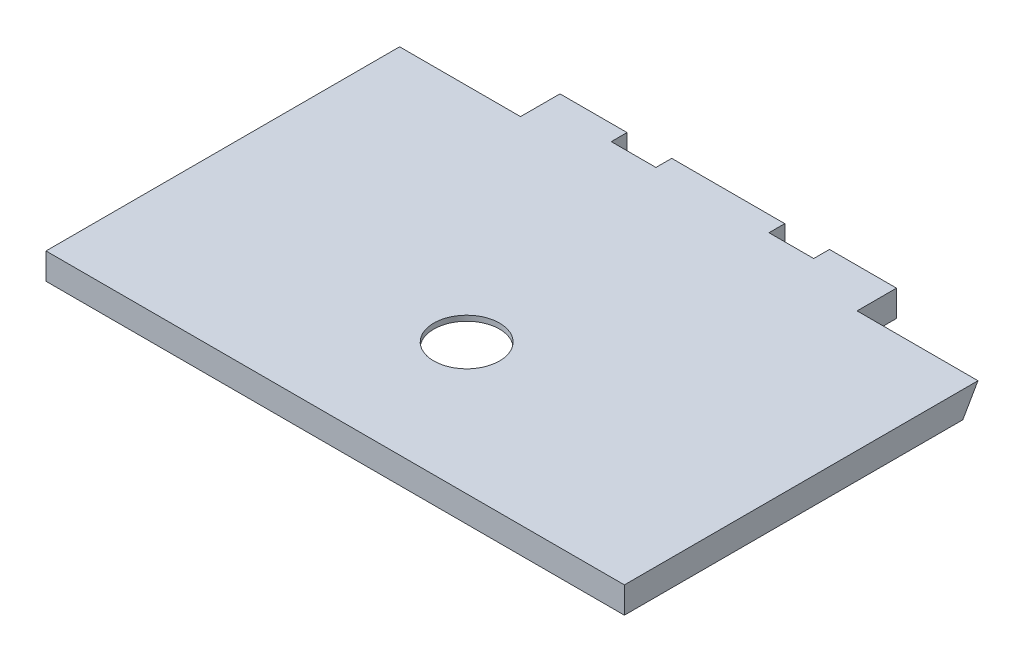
ISO-10303-21;
HEADER;
FILE_DESCRIPTION(('STEP AP214'),'2;1');
FILE_NAME('part.step','',(''),(''),'','','');
FILE_SCHEMA(('AUTOMOTIVE_DESIGN { 1 0 10303 214 1 1 1 1 }'));
ENDSEC;
DATA;
#1=APPLICATION_CONTEXT('core data for automotive mechanical design processes');
#2=APPLICATION_PROTOCOL_DEFINITION('international standard','automotive_design',2000,#1);
#3=PRODUCT_CONTEXT('',#1,'mechanical');
#4=PRODUCT('Part','Part','',(#3));
#5=PRODUCT_RELATED_PRODUCT_CATEGORY('part','',(#4));
#6=PRODUCT_DEFINITION_FORMATION('','',#4);
#7=PRODUCT_DEFINITION_CONTEXT('part definition',#1,'design');
#8=PRODUCT_DEFINITION('design','',#6,#7);
#9=PRODUCT_DEFINITION_SHAPE('','',#8);
#10=(LENGTH_UNIT() NAMED_UNIT(*) SI_UNIT(.MILLI.,.METRE.));
#11=(NAMED_UNIT(*) PLANE_ANGLE_UNIT() SI_UNIT($,.RADIAN.));
#12=(NAMED_UNIT(*) SI_UNIT($,.STERADIAN.) SOLID_ANGLE_UNIT());
#13=UNCERTAINTY_MEASURE_WITH_UNIT(LENGTH_MEASURE(1.E-05),#10,'distance_accuracy_value','');
#14=(GEOMETRIC_REPRESENTATION_CONTEXT(3) GLOBAL_UNCERTAINTY_ASSIGNED_CONTEXT((#13)) GLOBAL_UNIT_ASSIGNED_CONTEXT((#10,
#11,#12)) REPRESENTATION_CONTEXT('',''));
#15=CARTESIAN_POINT('',(0.,0.,0.));
#16=DIRECTION('',(0.,0.,1.));
#17=DIRECTION('',(1.,0.,0.));
#18=AXIS2_PLACEMENT_3D('',#15,#16,#17);
#19=CARTESIAN_POINT('',(0.,-10.,0.));
#20=DIRECTION('',(0.,1.,0.));
#21=DIRECTION('',(0.,0.,1.));
#22=AXIS2_PLACEMENT_3D('',#19,#20,#21);
#23=CYLINDRICAL_SURFACE('',#22,12.5);
#24=CARTESIAN_POINT('',(0.,0.,0.));
#25=DIRECTION('',(0.,1.,0.));
#26=DIRECTION('',(0.,0.,1.));
#27=AXIS2_PLACEMENT_3D('',#24,#25,#26);
#28=CIRCLE('',#27,12.5);
#29=CARTESIAN_POINT('',(0.,0.,12.5));
#30=VERTEX_POINT('',#29);
#31=EDGE_CURVE('E260',#30,#30,#28,.T.);
#32=ORIENTED_EDGE('',*,*,#31,.T.);
#33=EDGE_LOOP('',(#32));
#34=FACE_BOUND('',#33,.T.);
#35=CARTESIAN_POINT('',(0.,-2.,0.));
#36=DIRECTION('',(0.,-1.,0.));
#37=DIRECTION('',(0.,0.,-1.));
#38=AXIS2_PLACEMENT_3D('',#35,#36,#37);
#39=CIRCLE('',#38,12.5);
#40=CARTESIAN_POINT('',(0.,-2.,-12.5));
#41=VERTEX_POINT('',#40);
#42=EDGE_CURVE('E40',#41,#41,#39,.F.);
#43=ORIENTED_EDGE('',*,*,#42,.F.);
#44=EDGE_LOOP('',(#43));
#45=FACE_BOUND('',#44,.T.);
#46=ADVANCED_FACE('F36',(#34,#45),#23,.F.);
#47=CARTESIAN_POINT('',(-64.,-10.,-99.5));
#48=DIRECTION('',(0.,0.,-1.));
#49=DIRECTION('',(-1.,0.,0.));
#50=AXIS2_PLACEMENT_3D('',#47,#48,#49);
#51=PLANE('',#50);
#52=DIRECTION('',(0.,1.,0.));
#53=VECTOR('',#52,1.);
#54=CARTESIAN_POINT('',(21.5,-10.,-99.5));
#55=LINE('',#54,#53);
#56=CARTESIAN_POINT('',(21.5,-10.,-99.5));
#57=VERTEX_POINT('',#56);
#58=CARTESIAN_POINT('',(21.5,0.,-99.5));
#59=VERTEX_POINT('',#58);
#60=EDGE_CURVE('E233',#57,#59,#55,.T.);
#61=ORIENTED_EDGE('',*,*,#60,.F.);
#62=DIRECTION('',(-1.,0.,0.));
#63=VECTOR('',#62,1.);
#64=CARTESIAN_POINT('',(-64.,-10.,-99.5));
#65=LINE('',#64,#63);
#66=CARTESIAN_POINT('',(-21.5,-10.,-99.5));
#67=VERTEX_POINT('',#66);
#68=EDGE_CURVE('E279',#57,#67,#65,.T.);
#69=ORIENTED_EDGE('',*,*,#68,.T.);
#70=DIRECTION('',(0.,1.,0.));
#71=VECTOR('',#70,1.);
#72=CARTESIAN_POINT('',(-21.5,-10.,-99.5));
#73=LINE('',#72,#71);
#74=CARTESIAN_POINT('',(-21.5,0.,-99.5));
#75=VERTEX_POINT('',#74);
#76=EDGE_CURVE('E261',#67,#75,#73,.T.);
#77=ORIENTED_EDGE('',*,*,#76,.T.);
#78=DIRECTION('',(-1.,0.,0.));
#79=VECTOR('',#78,1.);
#80=CARTESIAN_POINT('',(-64.,0.,-99.5));
#81=LINE('',#80,#79);
#82=EDGE_CURVE('E300',#59,#75,#81,.T.);
#83=ORIENTED_EDGE('',*,*,#82,.F.);
#84=EDGE_LOOP('',(#61,#69,#77,#83));
#85=FACE_BOUND('',#84,.T.);
#86=ADVANCED_FACE('F352',(#85),#51,.T.);
#87=DIRECTION('',(0.,1.,0.));
#88=VECTOR('',#87,1.);
#89=CARTESIAN_POINT('',(-38.5,-10.,-99.5));
#90=LINE('',#89,#88);
#91=CARTESIAN_POINT('',(-38.5,-10.,-99.5));
#92=VERTEX_POINT('',#91);
#93=CARTESIAN_POINT('',(-38.5,0.,-99.5));
#94=VERTEX_POINT('',#93);
#95=EDGE_CURVE('E258',#92,#94,#90,.T.);
#96=ORIENTED_EDGE('',*,*,#95,.F.);
#97=CARTESIAN_POINT('',(-64.,-10.,-99.5));
#98=VERTEX_POINT('',#97);
#99=EDGE_CURVE('E273',#92,#98,#65,.T.);
#100=ORIENTED_EDGE('',*,*,#99,.T.);
#101=DIRECTION('',(0.,1.,0.));
#102=VECTOR('',#101,1.);
#103=CARTESIAN_POINT('',(-64.,-10.,-99.5));
#104=LINE('',#103,#102);
#105=CARTESIAN_POINT('',(-64.,0.,-99.5));
#106=VERTEX_POINT('',#105);
#107=EDGE_CURVE('E315',#98,#106,#104,.T.);
#108=ORIENTED_EDGE('',*,*,#107,.T.);
#109=EDGE_CURVE('E295',#94,#106,#81,.T.);
#110=ORIENTED_EDGE('',*,*,#109,.F.);
#111=EDGE_LOOP('',(#96,#100,#108,#110));
#112=FACE_BOUND('',#111,.T.);
#113=ADVANCED_FACE('F359',(#112),#51,.T.);
#114=CARTESIAN_POINT('',(110.,-10.,-84.5));
#115=DIRECTION('',(1.,0.,0.));
#116=DIRECTION('',(0.,0.,-1.));
#117=AXIS2_PLACEMENT_3D('',#114,#115,#116);
#118=PLANE('',#117);
#119=DIRECTION('',(0.,-0.866025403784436,0.500000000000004));
#120=VECTOR('',#119,1.);
#121=CARTESIAN_POINT('',(110.,0.,-84.5));
#122=LINE('',#121,#120);
#123=CARTESIAN_POINT('',(110.,0.,-84.5));
#124=VERTEX_POINT('',#123);
#125=CARTESIAN_POINT('',(110.,-10.,-78.7264973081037));
#126=VERTEX_POINT('',#125);
#127=EDGE_CURVE('E207',#124,#126,#122,.T.);
#128=ORIENTED_EDGE('',*,*,#127,.F.);
#129=DIRECTION('',(0.,0.,-1.));
#130=VECTOR('',#129,1.);
#131=CARTESIAN_POINT('',(110.,0.,-84.5));
#132=LINE('',#131,#130);
#133=CARTESIAN_POINT('',(110.,0.,50.));
#134=VERTEX_POINT('',#133);
#135=EDGE_CURVE('E274',#134,#124,#132,.T.);
#136=ORIENTED_EDGE('',*,*,#135,.F.);
#137=DIRECTION('',(0.,1.,0.));
#138=VECTOR('',#137,1.);
#139=CARTESIAN_POINT('',(110.,-10.,50.));
#140=LINE('',#139,#138);
#141=CARTESIAN_POINT('',(110.,-10.,50.));
#142=VERTEX_POINT('',#141);
#143=EDGE_CURVE('E11',#142,#134,#140,.T.);
#144=ORIENTED_EDGE('',*,*,#143,.F.);
#145=DIRECTION('',(0.,0.,-1.));
#146=VECTOR('',#145,1.);
#147=CARTESIAN_POINT('',(110.,-10.,-84.5));
#148=LINE('',#147,#146);
#149=EDGE_CURVE('E286',#142,#126,#148,.T.);
#150=ORIENTED_EDGE('',*,*,#149,.T.);
#151=EDGE_LOOP('',(#128,#136,#144,#150));
#152=FACE_BOUND('',#151,.T.);
#153=ADVANCED_FACE('F334',(#152),#118,.T.);
#154=CARTESIAN_POINT('',(110.,-10.,50.));
#155=DIRECTION('',(0.,0.,1.));
#156=DIRECTION('',(1.,0.,0.));
#157=AXIS2_PLACEMENT_3D('',#154,#155,#156);
#158=PLANE('',#157);
#159=DIRECTION('',(1.,0.,0.));
#160=VECTOR('',#159,1.);
#161=CARTESIAN_POINT('',(110.,0.,50.));
#162=LINE('',#161,#160);
#163=CARTESIAN_POINT('',(-110.,0.,50.));
#164=VERTEX_POINT('',#163);
#165=EDGE_CURVE('E309',#164,#134,#162,.T.);
#166=ORIENTED_EDGE('',*,*,#165,.F.);
#167=DIRECTION('',(0.,1.,0.));
#168=VECTOR('',#167,1.);
#169=CARTESIAN_POINT('',(-110.,-10.,50.));
#170=LINE('',#169,#168);
#171=CARTESIAN_POINT('',(-110.,-10.,50.));
#172=VERTEX_POINT('',#171);
#173=EDGE_CURVE('E45',#172,#164,#170,.T.);
#174=ORIENTED_EDGE('',*,*,#173,.F.);
#175=DIRECTION('',(1.,0.,0.));
#176=VECTOR('',#175,1.);
#177=CARTESIAN_POINT('',(110.,-10.,50.));
#178=LINE('',#177,#176);
#179=EDGE_CURVE('E283',#172,#142,#178,.T.);
#180=ORIENTED_EDGE('',*,*,#179,.T.);
#181=ORIENTED_EDGE('',*,*,#143,.T.);
#182=EDGE_LOOP('',(#166,#174,#180,#181));
#183=FACE_BOUND('',#182,.T.);
#184=ADVANCED_FACE('F405',(#183),#158,.T.);
#185=CARTESIAN_POINT('',(-110.,-10.,50.));
#186=DIRECTION('',(-1.,0.,0.));
#187=DIRECTION('',(0.,0.,1.));
#188=AXIS2_PLACEMENT_3D('',#185,#186,#187);
#189=PLANE('',#188);
#190=DIRECTION('',(0.,0.866025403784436,-0.500000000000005));
#191=VECTOR('',#190,1.);
#192=CARTESIAN_POINT('',(-110.,-10.,-78.7264973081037));
#193=LINE('',#192,#191);
#194=CARTESIAN_POINT('',(-110.,-10.,-78.7264973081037));
#195=VERTEX_POINT('',#194);
#196=CARTESIAN_POINT('',(-110.,0.,-84.5));
#197=VERTEX_POINT('',#196);
#198=EDGE_CURVE('E203',#195,#197,#193,.T.);
#199=ORIENTED_EDGE('',*,*,#198,.F.);
#200=DIRECTION('',(0.,0.,1.));
#201=VECTOR('',#200,1.);
#202=CARTESIAN_POINT('',(-110.,-10.,50.));
#203=LINE('',#202,#201);
#204=EDGE_CURVE('E281',#195,#172,#203,.T.);
#205=ORIENTED_EDGE('',*,*,#204,.T.);
#206=ORIENTED_EDGE('',*,*,#173,.T.);
#207=DIRECTION('',(0.,0.,1.));
#208=VECTOR('',#207,1.);
#209=CARTESIAN_POINT('',(-110.,0.,50.));
#210=LINE('',#209,#208);
#211=EDGE_CURVE('E306',#197,#164,#210,.T.);
#212=ORIENTED_EDGE('',*,*,#211,.F.);
#213=EDGE_LOOP('',(#199,#205,#206,#212));
#214=FACE_BOUND('',#213,.T.);
#215=ADVANCED_FACE('F371',(#214),#189,.T.);
#216=CARTESIAN_POINT('',(-64.,-10.,-84.5));
#217=DIRECTION('',(-1.,0.,0.));
#218=DIRECTION('',(0.,0.,1.));
#219=AXIS2_PLACEMENT_3D('',#216,#217,#218);
#220=PLANE('',#219);
#221=DIRECTION('',(0.,0.,1.));
#222=VECTOR('',#221,1.);
#223=CARTESIAN_POINT('',(-64.,0.,-84.5));
#224=LINE('',#223,#222);
#225=CARTESIAN_POINT('',(-64.,0.,-84.5));
#226=VERTEX_POINT('',#225);
#227=EDGE_CURVE('E299',#106,#226,#224,.T.);
#228=ORIENTED_EDGE('',*,*,#227,.F.);
#229=ORIENTED_EDGE('',*,*,#107,.F.);
#230=DIRECTION('',(0.,0.,1.));
#231=VECTOR('',#230,1.);
#232=CARTESIAN_POINT('',(-64.,-10.,-84.5));
#233=LINE('',#232,#231);
#234=CARTESIAN_POINT('',(-64.,-10.,-78.7264973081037));
#235=VERTEX_POINT('',#234);
#236=EDGE_CURVE('E278',#98,#235,#233,.T.);
#237=ORIENTED_EDGE('',*,*,#236,.T.);
#238=DIRECTION('',(0.,-0.866025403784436,0.500000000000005));
#239=VECTOR('',#238,1.);
#240=CARTESIAN_POINT('',(-64.,-10.,-78.7264973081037));
#241=LINE('',#240,#239);
#242=EDGE_CURVE('E204',#226,#235,#241,.T.);
#243=ORIENTED_EDGE('',*,*,#242,.F.);
#244=EDGE_LOOP('',(#228,#229,#237,#243));
#245=FACE_BOUND('',#244,.T.);
#246=ADVANCED_FACE('F364',(#245),#220,.T.);
#247=DIRECTION('',(0.,1.,0.));
#248=VECTOR('',#247,1.);
#249=CARTESIAN_POINT('',(38.5,-10.,-99.5));
#250=LINE('',#249,#248);
#251=CARTESIAN_POINT('',(38.5,-10.,-99.5));
#252=VERTEX_POINT('',#251);
#253=CARTESIAN_POINT('',(38.5,0.,-99.5));
#254=VERTEX_POINT('',#253);
#255=EDGE_CURVE('E235',#252,#254,#250,.T.);
#256=ORIENTED_EDGE('',*,*,#255,.T.);
#257=CARTESIAN_POINT('',(64.,0.,-99.5));
#258=VERTEX_POINT('',#257);
#259=EDGE_CURVE('E296',#258,#254,#81,.T.);
#260=ORIENTED_EDGE('',*,*,#259,.F.);
#261=DIRECTION('',(0.,1.,0.));
#262=VECTOR('',#261,1.);
#263=CARTESIAN_POINT('',(64.,-10.,-99.5));
#264=LINE('',#263,#262);
#265=CARTESIAN_POINT('',(64.,-10.,-99.5));
#266=VERTEX_POINT('',#265);
#267=EDGE_CURVE('E289',#266,#258,#264,.T.);
#268=ORIENTED_EDGE('',*,*,#267,.F.);
#269=EDGE_CURVE('E275',#266,#252,#65,.T.);
#270=ORIENTED_EDGE('',*,*,#269,.T.);
#271=EDGE_LOOP('',(#256,#260,#268,#270));
#272=FACE_BOUND('',#271,.T.);
#273=ADVANCED_FACE('F323',(#272),#51,.T.);
#274=CARTESIAN_POINT('',(64.,-10.,-99.5));
#275=DIRECTION('',(1.,0.,0.));
#276=DIRECTION('',(0.,0.,-1.));
#277=AXIS2_PLACEMENT_3D('',#274,#275,#276);
#278=PLANE('',#277);
#279=DIRECTION('',(0.,0.,-1.));
#280=VECTOR('',#279,1.);
#281=CARTESIAN_POINT('',(64.,0.,-99.5));
#282=LINE('',#281,#280);
#283=CARTESIAN_POINT('',(64.,0.,-84.5));
#284=VERTEX_POINT('',#283);
#285=EDGE_CURVE('E292',#284,#258,#282,.T.);
#286=ORIENTED_EDGE('',*,*,#285,.F.);
#287=DIRECTION('',(0.,0.866025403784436,-0.500000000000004));
#288=VECTOR('',#287,1.);
#289=CARTESIAN_POINT('',(64.,0.,-84.5));
#290=LINE('',#289,#288);
#291=CARTESIAN_POINT('',(64.,-10.,-78.7264973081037));
#292=VERTEX_POINT('',#291);
#293=EDGE_CURVE('E215',#292,#284,#290,.T.);
#294=ORIENTED_EDGE('',*,*,#293,.F.);
#295=DIRECTION('',(0.,0.,-1.));
#296=VECTOR('',#295,1.);
#297=CARTESIAN_POINT('',(64.,-10.,-99.5));
#298=LINE('',#297,#296);
#299=EDGE_CURVE('E270',#292,#266,#298,.T.);
#300=ORIENTED_EDGE('',*,*,#299,.T.);
#301=ORIENTED_EDGE('',*,*,#267,.T.);
#302=EDGE_LOOP('',(#286,#294,#300,#301));
#303=FACE_BOUND('',#302,.T.);
#304=ADVANCED_FACE('F38',(#303),#278,.T.);
#305=CARTESIAN_POINT('',(0.,-10.,0.));
#306=DIRECTION('',(0.,-1.,0.));
#307=DIRECTION('',(0.,0.,-1.));
#308=AXIS2_PLACEMENT_3D('',#305,#306,#307);
#309=PLANE('',#308);
#310=CARTESIAN_POINT('',(0.,-10.,0.));
#311=DIRECTION('',(0.,-1.,0.));
#312=DIRECTION('',(0.,0.,-1.));
#313=AXIS2_PLACEMENT_3D('',#310,#311,#312);
#314=CIRCLE('',#313,27.5);
#315=CARTESIAN_POINT('',(0.,-10.,-27.5));
#316=VERTEX_POINT('',#315);
#317=EDGE_CURVE('E671',#316,#316,#314,.T.);
#318=ORIENTED_EDGE('',*,*,#317,.F.);
#319=EDGE_LOOP('',(#318));
#320=FACE_BOUND('',#319,.T.);
#321=CARTESIAN_POINT('',(0.,-10.,-94.9964973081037));
#322=DIRECTION('',(0.,-1.,0.));
#323=DIRECTION('',(0.,0.,-1.));
#324=AXIS2_PLACEMENT_3D('',#321,#322,#323);
#325=CIRCLE('',#324,1.64999999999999);
#326=CARTESIAN_POINT('',(0.,-10.,-96.6464973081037));
#327=VERTEX_POINT('',#326);
#328=EDGE_CURVE('E174',#327,#327,#325,.T.);
#329=ORIENTED_EDGE('',*,*,#328,.F.);
#330=EDGE_LOOP('',(#329));
#331=FACE_BOUND('',#330,.T.);
#332=CARTESIAN_POINT('',(-59.,-10.,24.0035026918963));
#333=DIRECTION('',(0.,-1.,0.));
#334=DIRECTION('',(0.,0.,-1.));
#335=AXIS2_PLACEMENT_3D('',#332,#333,#334);
#336=CIRCLE('',#335,1.65);
#337=CARTESIAN_POINT('',(-59.,-10.,22.3535026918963));
#338=VERTEX_POINT('',#337);
#339=EDGE_CURVE('E173',#338,#338,#336,.T.);
#340=ORIENTED_EDGE('',*,*,#339,.F.);
#341=EDGE_LOOP('',(#340));
#342=FACE_BOUND('',#341,.T.);
#343=CARTESIAN_POINT('',(-59.,-10.,-55.9964973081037));
#344=DIRECTION('',(0.,-1.,0.));
#345=DIRECTION('',(0.,0.,-1.));
#346=AXIS2_PLACEMENT_3D('',#343,#344,#345);
#347=CIRCLE('',#346,1.65);
#348=CARTESIAN_POINT('',(-59.,-10.,-57.6464973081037));
#349=VERTEX_POINT('',#348);
#350=EDGE_CURVE('E185',#349,#349,#347,.T.);
#351=ORIENTED_EDGE('',*,*,#350,.F.);
#352=EDGE_LOOP('',(#351));
#353=FACE_BOUND('',#352,.T.);
#354=CARTESIAN_POINT('',(59.,-10.,24.0035026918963));
#355=DIRECTION('',(0.,-1.,0.));
#356=DIRECTION('',(0.,0.,-1.));
#357=AXIS2_PLACEMENT_3D('',#354,#355,#356);
#358=CIRCLE('',#357,1.65);
#359=CARTESIAN_POINT('',(59.,-10.,22.3535026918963));
#360=VERTEX_POINT('',#359);
#361=EDGE_CURVE('E191',#360,#360,#358,.T.);
#362=ORIENTED_EDGE('',*,*,#361,.F.);
#363=EDGE_LOOP('',(#362));
#364=FACE_BOUND('',#363,.T.);
#365=CARTESIAN_POINT('',(59.,-10.,-55.9964973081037));
#366=DIRECTION('',(0.,-1.,0.));
#367=DIRECTION('',(0.,0.,-1.));
#368=AXIS2_PLACEMENT_3D('',#365,#366,#367);
#369=CIRCLE('',#368,1.65);
#370=CARTESIAN_POINT('',(59.,-10.,-57.6464973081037));
#371=VERTEX_POINT('',#370);
#372=EDGE_CURVE('E197',#371,#371,#369,.T.);
#373=ORIENTED_EDGE('',*,*,#372,.F.);
#374=EDGE_LOOP('',(#373));
#375=FACE_BOUND('',#374,.T.);
#376=DIRECTION('',(-1.,0.,0.));
#377=VECTOR('',#376,1.);
#378=CARTESIAN_POINT('',(-52.4529946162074,-10.,-78.7264973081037));
#379=LINE('',#378,#377);
#380=EDGE_CURVE('E208',#235,#195,#379,.T.);
#381=ORIENTED_EDGE('',*,*,#380,.F.);
#382=ORIENTED_EDGE('',*,*,#236,.F.);
#383=ORIENTED_EDGE('',*,*,#99,.F.);
#384=DIRECTION('',(0.,0.,1.));
#385=VECTOR('',#384,1.);
#386=CARTESIAN_POINT('',(-38.5,-10.,-99.5));
#387=LINE('',#386,#385);
#388=CARTESIAN_POINT('',(-38.5,-10.,-93.5));
#389=VERTEX_POINT('',#388);
#390=EDGE_CURVE('E241',#92,#389,#387,.T.);
#391=ORIENTED_EDGE('',*,*,#390,.T.);
#392=DIRECTION('',(1.,0.,0.));
#393=VECTOR('',#392,1.);
#394=CARTESIAN_POINT('',(-38.5,-10.,-93.5));
#395=LINE('',#394,#393);
#396=CARTESIAN_POINT('',(-21.5,-10.,-93.5));
#397=VERTEX_POINT('',#396);
#398=EDGE_CURVE('E244',#389,#397,#395,.T.);
#399=ORIENTED_EDGE('',*,*,#398,.T.);
#400=DIRECTION('',(0.,0.,-1.));
#401=VECTOR('',#400,1.);
#402=CARTESIAN_POINT('',(-21.5,-10.,-99.5));
#403=LINE('',#402,#401);
#404=EDGE_CURVE('E248',#397,#67,#403,.T.);
#405=ORIENTED_EDGE('',*,*,#404,.T.);
#406=ORIENTED_EDGE('',*,*,#68,.F.);
#407=DIRECTION('',(0.,0.,1.));
#408=VECTOR('',#407,1.);
#409=CARTESIAN_POINT('',(21.5,-10.,-99.5));
#410=LINE('',#409,#408);
#411=CARTESIAN_POINT('',(21.5,-10.,-93.5));
#412=VERTEX_POINT('',#411);
#413=EDGE_CURVE('E217',#57,#412,#410,.T.);
#414=ORIENTED_EDGE('',*,*,#413,.T.);
#415=DIRECTION('',(1.,0.,0.));
#416=VECTOR('',#415,1.);
#417=CARTESIAN_POINT('',(21.5,-10.,-93.5));
#418=LINE('',#417,#416);
#419=CARTESIAN_POINT('',(38.5,-10.,-93.5));
#420=VERTEX_POINT('',#419);
#421=EDGE_CURVE('E220',#412,#420,#418,.T.);
#422=ORIENTED_EDGE('',*,*,#421,.T.);
#423=DIRECTION('',(0.,0.,-1.));
#424=VECTOR('',#423,1.);
#425=CARTESIAN_POINT('',(38.5,-10.,-99.5));
#426=LINE('',#425,#424);
#427=EDGE_CURVE('E224',#420,#252,#426,.T.);
#428=ORIENTED_EDGE('',*,*,#427,.T.);
#429=ORIENTED_EDGE('',*,*,#269,.F.);
#430=ORIENTED_EDGE('',*,*,#299,.F.);
#431=DIRECTION('',(1.,0.,0.));
#432=VECTOR('',#431,1.);
#433=CARTESIAN_POINT('',(52.4529946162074,-10.,-78.7264973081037));
#434=LINE('',#433,#432);
#435=EDGE_CURVE('E212',#292,#126,#434,.T.);
#436=ORIENTED_EDGE('',*,*,#435,.T.);
#437=ORIENTED_EDGE('',*,*,#149,.F.);
#438=ORIENTED_EDGE('',*,*,#179,.F.);
#439=ORIENTED_EDGE('',*,*,#204,.F.);
#440=EDGE_LOOP('',(#381,#382,#383,#391,#399,#405,#406,#414,#422,#428,#429,#430,#436,#437,#438,#439));
#441=FACE_BOUND('',#440,.T.);
#442=ADVANCED_FACE('F339',(#320,#331,#342,#353,#364,#375,#441),#309,.T.);
#443=CARTESIAN_POINT('',(0.,0.,0.));
#444=DIRECTION('',(0.,-1.,0.));
#445=DIRECTION('',(0.,0.,-1.));
#446=AXIS2_PLACEMENT_3D('',#443,#444,#445);
#447=PLANE('',#446);
#448=ORIENTED_EDGE('',*,*,#31,.F.);
#449=EDGE_LOOP('',(#448));
#450=FACE_BOUND('',#449,.T.);
#451=DIRECTION('',(1.,0.,0.));
#452=VECTOR('',#451,1.);
#453=CARTESIAN_POINT('',(21.5,0.,-93.5));
#454=LINE('',#453,#452);
#455=CARTESIAN_POINT('',(21.5,0.,-93.5));
#456=VERTEX_POINT('',#455);
#457=CARTESIAN_POINT('',(38.5,0.,-93.5));
#458=VERTEX_POINT('',#457);
#459=EDGE_CURVE('E229',#456,#458,#454,.T.);
#460=ORIENTED_EDGE('',*,*,#459,.F.);
#461=DIRECTION('',(0.,0.,1.));
#462=VECTOR('',#461,1.);
#463=CARTESIAN_POINT('',(21.5,0.,-99.5));
#464=LINE('',#463,#462);
#465=EDGE_CURVE('E53',#59,#456,#464,.T.);
#466=ORIENTED_EDGE('',*,*,#465,.F.);
#467=ORIENTED_EDGE('',*,*,#82,.T.);
#468=DIRECTION('',(0.,0.,-1.));
#469=VECTOR('',#468,1.);
#470=CARTESIAN_POINT('',(-21.5,0.,-99.5));
#471=LINE('',#470,#469);
#472=CARTESIAN_POINT('',(-21.5,0.,-93.5));
#473=VERTEX_POINT('',#472);
#474=EDGE_CURVE('E245',#473,#75,#471,.T.);
#475=ORIENTED_EDGE('',*,*,#474,.F.);
#476=DIRECTION('',(1.,0.,0.));
#477=VECTOR('',#476,1.);
#478=CARTESIAN_POINT('',(-38.5,0.,-93.5));
#479=LINE('',#478,#477);
#480=CARTESIAN_POINT('',(-38.5,0.,-93.5));
#481=VERTEX_POINT('',#480);
#482=EDGE_CURVE('E253',#481,#473,#479,.T.);
#483=ORIENTED_EDGE('',*,*,#482,.F.);
#484=DIRECTION('',(0.,0.,1.));
#485=VECTOR('',#484,1.);
#486=CARTESIAN_POINT('',(-38.5,0.,-99.5));
#487=LINE('',#486,#485);
#488=EDGE_CURVE('E61',#94,#481,#487,.T.);
#489=ORIENTED_EDGE('',*,*,#488,.F.);
#490=ORIENTED_EDGE('',*,*,#109,.T.);
#491=ORIENTED_EDGE('',*,*,#227,.T.);
#492=DIRECTION('',(-1.,0.,0.));
#493=VECTOR('',#492,1.);
#494=CARTESIAN_POINT('',(-110.,0.,-84.5));
#495=LINE('',#494,#493);
#496=EDGE_CURVE('E303',#226,#197,#495,.T.);
#497=ORIENTED_EDGE('',*,*,#496,.T.);
#498=ORIENTED_EDGE('',*,*,#211,.T.);
#499=ORIENTED_EDGE('',*,*,#165,.T.);
#500=ORIENTED_EDGE('',*,*,#135,.T.);
#501=DIRECTION('',(-1.,0.,0.));
#502=VECTOR('',#501,1.);
#503=CARTESIAN_POINT('',(64.,0.,-84.5));
#504=LINE('',#503,#502);
#505=EDGE_CURVE('E269',#124,#284,#504,.T.);
#506=ORIENTED_EDGE('',*,*,#505,.T.);
#507=ORIENTED_EDGE('',*,*,#285,.T.);
#508=ORIENTED_EDGE('',*,*,#259,.T.);
#509=DIRECTION('',(0.,0.,-1.));
#510=VECTOR('',#509,1.);
#511=CARTESIAN_POINT('',(38.5,0.,-99.5));
#512=LINE('',#511,#510);
#513=EDGE_CURVE('E221',#458,#254,#512,.T.);
#514=ORIENTED_EDGE('',*,*,#513,.F.);
#515=EDGE_LOOP('',(#460,#466,#467,#475,#483,#489,#490,#491,#497,#498,#499,#500,#506,#507,#508,#514));
#516=FACE_BOUND('',#515,.T.);
#517=ADVANCED_FACE('F327',(#450,#516),#447,.F.);
#518=CARTESIAN_POINT('',(-38.5,-10.,-99.5));
#519=DIRECTION('',(-1.,0.,0.));
#520=DIRECTION('',(0.,0.,1.));
#521=AXIS2_PLACEMENT_3D('',#518,#519,#520);
#522=PLANE('',#521);
#523=ORIENTED_EDGE('',*,*,#488,.T.);
#524=DIRECTION('',(0.,1.,0.));
#525=VECTOR('',#524,1.);
#526=CARTESIAN_POINT('',(-38.5,-10.,-93.5));
#527=LINE('',#526,#525);
#528=EDGE_CURVE('E251',#389,#481,#527,.T.);
#529=ORIENTED_EDGE('',*,*,#528,.F.);
#530=ORIENTED_EDGE('',*,*,#390,.F.);
#531=ORIENTED_EDGE('',*,*,#95,.T.);
#532=EDGE_LOOP('',(#523,#529,#530,#531));
#533=FACE_BOUND('',#532,.T.);
#534=ADVANCED_FACE('F381',(#533),#522,.F.);
#535=CARTESIAN_POINT('',(-21.5,-10.,-99.5));
#536=DIRECTION('',(1.,0.,0.));
#537=DIRECTION('',(0.,0.,-1.));
#538=AXIS2_PLACEMENT_3D('',#535,#536,#537);
#539=PLANE('',#538);
#540=ORIENTED_EDGE('',*,*,#474,.T.);
#541=ORIENTED_EDGE('',*,*,#76,.F.);
#542=ORIENTED_EDGE('',*,*,#404,.F.);
#543=DIRECTION('',(0.,1.,0.));
#544=VECTOR('',#543,1.);
#545=CARTESIAN_POINT('',(-21.5,-10.,-93.5));
#546=LINE('',#545,#544);
#547=EDGE_CURVE('E264',#397,#473,#546,.T.);
#548=ORIENTED_EDGE('',*,*,#547,.T.);
#549=EDGE_LOOP('',(#540,#541,#542,#548));
#550=FACE_BOUND('',#549,.T.);
#551=ADVANCED_FACE('F377',(#550),#539,.F.);
#552=CARTESIAN_POINT('',(-38.5,-10.,-93.5));
#553=DIRECTION('',(0.,0.,1.));
#554=DIRECTION('',(1.,0.,0.));
#555=AXIS2_PLACEMENT_3D('',#552,#553,#554);
#556=PLANE('',#555);
#557=ORIENTED_EDGE('',*,*,#482,.T.);
#558=ORIENTED_EDGE('',*,*,#547,.F.);
#559=ORIENTED_EDGE('',*,*,#398,.F.);
#560=ORIENTED_EDGE('',*,*,#528,.T.);
#561=EDGE_LOOP('',(#557,#558,#559,#560));
#562=FACE_BOUND('',#561,.T.);
#563=ADVANCED_FACE('F380',(#562),#556,.F.);
#564=CARTESIAN_POINT('',(21.5,-10.,-99.5));
#565=DIRECTION('',(-1.,0.,0.));
#566=DIRECTION('',(0.,0.,1.));
#567=AXIS2_PLACEMENT_3D('',#564,#565,#566);
#568=PLANE('',#567);
#569=ORIENTED_EDGE('',*,*,#465,.T.);
#570=DIRECTION('',(0.,1.,0.));
#571=VECTOR('',#570,1.);
#572=CARTESIAN_POINT('',(21.5,-10.,-93.5));
#573=LINE('',#572,#571);
#574=EDGE_CURVE('E227',#412,#456,#573,.T.);
#575=ORIENTED_EDGE('',*,*,#574,.F.);
#576=ORIENTED_EDGE('',*,*,#413,.F.);
#577=ORIENTED_EDGE('',*,*,#60,.T.);
#578=EDGE_LOOP('',(#569,#575,#576,#577));
#579=FACE_BOUND('',#578,.T.);
#580=ADVANCED_FACE('F348',(#579),#568,.F.);
#581=CARTESIAN_POINT('',(38.5,-10.,-99.5));
#582=DIRECTION('',(1.,0.,0.));
#583=DIRECTION('',(0.,0.,-1.));
#584=AXIS2_PLACEMENT_3D('',#581,#582,#583);
#585=PLANE('',#584);
#586=ORIENTED_EDGE('',*,*,#513,.T.);
#587=ORIENTED_EDGE('',*,*,#255,.F.);
#588=ORIENTED_EDGE('',*,*,#427,.F.);
#589=DIRECTION('',(0.,1.,0.));
#590=VECTOR('',#589,1.);
#591=CARTESIAN_POINT('',(38.5,-10.,-93.5));
#592=LINE('',#591,#590);
#593=EDGE_CURVE('E238',#420,#458,#592,.T.);
#594=ORIENTED_EDGE('',*,*,#593,.T.);
#595=EDGE_LOOP('',(#586,#587,#588,#594));
#596=FACE_BOUND('',#595,.T.);
#597=ADVANCED_FACE('F344',(#596),#585,.F.);
#598=CARTESIAN_POINT('',(21.5,-10.,-93.5));
#599=DIRECTION('',(0.,0.,1.));
#600=DIRECTION('',(1.,0.,0.));
#601=AXIS2_PLACEMENT_3D('',#598,#599,#600);
#602=PLANE('',#601);
#603=ORIENTED_EDGE('',*,*,#459,.T.);
#604=ORIENTED_EDGE('',*,*,#593,.F.);
#605=ORIENTED_EDGE('',*,*,#421,.F.);
#606=ORIENTED_EDGE('',*,*,#574,.T.);
#607=EDGE_LOOP('',(#603,#604,#605,#606));
#608=FACE_BOUND('',#607,.T.);
#609=ADVANCED_FACE('F347',(#608),#602,.F.);
#610=CARTESIAN_POINT('',(52.4529946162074,0.,-84.5));
#611=DIRECTION('',(0.,0.500000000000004,0.866025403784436));
#612=DIRECTION('',(0.,-0.866025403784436,0.500000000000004));
#613=AXIS2_PLACEMENT_3D('',#610,#611,#612);
#614=PLANE('',#613);
#615=ORIENTED_EDGE('',*,*,#293,.T.);
#616=ORIENTED_EDGE('',*,*,#505,.F.);
#617=ORIENTED_EDGE('',*,*,#127,.T.);
#618=ORIENTED_EDGE('',*,*,#435,.F.);
#619=EDGE_LOOP('',(#615,#616,#617,#618));
#620=FACE_BOUND('',#619,.T.);
#621=ADVANCED_FACE('F331',(#620),#614,.F.);
#622=CARTESIAN_POINT('',(-52.4529946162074,-10.,-78.7264973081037));
#623=DIRECTION('',(0.,0.500000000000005,0.866025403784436));
#624=DIRECTION('',(0.,-0.866025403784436,0.500000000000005));
#625=AXIS2_PLACEMENT_3D('',#622,#623,#624);
#626=PLANE('',#625);
#627=ORIENTED_EDGE('',*,*,#242,.T.);
#628=ORIENTED_EDGE('',*,*,#380,.T.);
#629=ORIENTED_EDGE('',*,*,#198,.T.);
#630=ORIENTED_EDGE('',*,*,#496,.F.);
#631=EDGE_LOOP('',(#627,#628,#629,#630));
#632=FACE_BOUND('',#631,.T.);
#633=ADVANCED_FACE('F367',(#632),#626,.F.);
#634=CARTESIAN_POINT('',(59.,-1.5,-55.9964973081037));
#635=DIRECTION('',(0.,-1.,0.));
#636=DIRECTION('',(0.,0.,-1.));
#637=AXIS2_PLACEMENT_3D('',#634,#635,#636);
#638=CONICAL_SURFACE('',#637,1.65,1.02974425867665);
#639=CARTESIAN_POINT('',(59.,-0.508579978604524,-55.9964973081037));
#640=VERTEX_POINT('',#639);
#641=VERTEX_LOOP('',#640);
#642=FACE_BOUND('',#641,.T.);
#643=CARTESIAN_POINT('',(59.,-1.5,-55.9964973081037));
#644=DIRECTION('',(0.,-1.,0.));
#645=DIRECTION('',(0.,0.,-1.));
#646=AXIS2_PLACEMENT_3D('',#643,#644,#645);
#647=CIRCLE('',#646,1.65);
#648=CARTESIAN_POINT('',(59.,-1.5,-57.6464973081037));
#649=VERTEX_POINT('',#648);
#650=EDGE_CURVE('E200',#649,#649,#647,.T.);
#651=ORIENTED_EDGE('',*,*,#650,.T.);
#652=EDGE_LOOP('',(#651));
#653=FACE_BOUND('',#652,.T.);
#654=ADVANCED_FACE('F458',(#642,#653),#638,.F.);
#655=CARTESIAN_POINT('',(59.,-10.,-55.9964973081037));
#656=DIRECTION('',(0.,-1.,0.));
#657=DIRECTION('',(0.,0.,-1.));
#658=AXIS2_PLACEMENT_3D('',#655,#656,#657);
#659=CYLINDRICAL_SURFACE('',#658,1.65);
#660=ORIENTED_EDGE('',*,*,#650,.F.);
#661=EDGE_LOOP('',(#660));
#662=FACE_BOUND('',#661,.T.);
#663=ORIENTED_EDGE('',*,*,#372,.T.);
#664=EDGE_LOOP('',(#663));
#665=FACE_BOUND('',#664,.T.);
#666=ADVANCED_FACE('F468',(#662,#665),#659,.F.);
#667=CARTESIAN_POINT('',(59.,-1.5,24.0035026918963));
#668=DIRECTION('',(0.,-1.,0.));
#669=DIRECTION('',(0.,0.,-1.));
#670=AXIS2_PLACEMENT_3D('',#667,#668,#669);
#671=CONICAL_SURFACE('',#670,1.65,1.02974425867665);
#672=CARTESIAN_POINT('',(59.,-0.508579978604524,24.0035026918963));
#673=VERTEX_POINT('',#672);
#674=VERTEX_LOOP('',#673);
#675=FACE_BOUND('',#674,.T.);
#676=CARTESIAN_POINT('',(59.,-1.5,24.0035026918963));
#677=DIRECTION('',(0.,-1.,0.));
#678=DIRECTION('',(0.,0.,-1.));
#679=AXIS2_PLACEMENT_3D('',#676,#677,#678);
#680=CIRCLE('',#679,1.65);
#681=CARTESIAN_POINT('',(59.,-1.5,22.3535026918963));
#682=VERTEX_POINT('',#681);
#683=EDGE_CURVE('E194',#682,#682,#680,.T.);
#684=ORIENTED_EDGE('',*,*,#683,.T.);
#685=EDGE_LOOP('',(#684));
#686=FACE_BOUND('',#685,.T.);
#687=ADVANCED_FACE('F479',(#675,#686),#671,.F.);
#688=CARTESIAN_POINT('',(59.,-10.,24.0035026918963));
#689=DIRECTION('',(0.,-1.,0.));
#690=DIRECTION('',(0.,0.,-1.));
#691=AXIS2_PLACEMENT_3D('',#688,#689,#690);
#692=CYLINDRICAL_SURFACE('',#691,1.65);
#693=ORIENTED_EDGE('',*,*,#683,.F.);
#694=EDGE_LOOP('',(#693));
#695=FACE_BOUND('',#694,.T.);
#696=ORIENTED_EDGE('',*,*,#361,.T.);
#697=EDGE_LOOP('',(#696));
#698=FACE_BOUND('',#697,.T.);
#699=ADVANCED_FACE('F492',(#695,#698),#692,.F.);
#700=CARTESIAN_POINT('',(-59.,-1.5,-55.9964973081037));
#701=DIRECTION('',(0.,-1.,0.));
#702=DIRECTION('',(0.,0.,-1.));
#703=AXIS2_PLACEMENT_3D('',#700,#701,#702);
#704=CONICAL_SURFACE('',#703,1.65,1.02974425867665);
#705=CARTESIAN_POINT('',(-59.,-0.508579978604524,-55.9964973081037));
#706=VERTEX_POINT('',#705);
#707=VERTEX_LOOP('',#706);
#708=FACE_BOUND('',#707,.T.);
#709=CARTESIAN_POINT('',(-59.,-1.5,-55.9964973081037));
#710=DIRECTION('',(0.,-1.,0.));
#711=DIRECTION('',(0.,0.,-1.));
#712=AXIS2_PLACEMENT_3D('',#709,#710,#711);
#713=CIRCLE('',#712,1.65);
#714=CARTESIAN_POINT('',(-59.,-1.5,-57.6464973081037));
#715=VERTEX_POINT('',#714);
#716=EDGE_CURVE('E188',#715,#715,#713,.T.);
#717=ORIENTED_EDGE('',*,*,#716,.T.);
#718=EDGE_LOOP('',(#717));
#719=FACE_BOUND('',#718,.T.);
#720=ADVANCED_FACE('F502',(#708,#719),#704,.F.);
#721=CARTESIAN_POINT('',(-59.,-10.,-55.9964973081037));
#722=DIRECTION('',(0.,-1.,0.));
#723=DIRECTION('',(0.,0.,-1.));
#724=AXIS2_PLACEMENT_3D('',#721,#722,#723);
#725=CYLINDRICAL_SURFACE('',#724,1.65);
#726=ORIENTED_EDGE('',*,*,#716,.F.);
#727=EDGE_LOOP('',(#726));
#728=FACE_BOUND('',#727,.T.);
#729=ORIENTED_EDGE('',*,*,#350,.T.);
#730=EDGE_LOOP('',(#729));
#731=FACE_BOUND('',#730,.T.);
#732=ADVANCED_FACE('F514',(#728,#731),#725,.F.);
#733=CARTESIAN_POINT('',(-59.,-1.5,24.0035026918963));
#734=DIRECTION('',(0.,-1.,0.));
#735=DIRECTION('',(0.,0.,-1.));
#736=AXIS2_PLACEMENT_3D('',#733,#734,#735);
#737=CONICAL_SURFACE('',#736,1.65,1.02974425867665);
#738=CARTESIAN_POINT('',(-59.,-0.508579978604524,24.0035026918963));
#739=VERTEX_POINT('',#738);
#740=VERTEX_LOOP('',#739);
#741=FACE_BOUND('',#740,.T.);
#742=CARTESIAN_POINT('',(-59.,-1.5,24.0035026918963));
#743=DIRECTION('',(0.,-1.,0.));
#744=DIRECTION('',(0.,0.,-1.));
#745=AXIS2_PLACEMENT_3D('',#742,#743,#744);
#746=CIRCLE('',#745,1.65);
#747=CARTESIAN_POINT('',(-59.,-1.5,22.3535026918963));
#748=VERTEX_POINT('',#747);
#749=EDGE_CURVE('E177',#748,#748,#746,.T.);
#750=ORIENTED_EDGE('',*,*,#749,.T.);
#751=EDGE_LOOP('',(#750));
#752=FACE_BOUND('',#751,.T.);
#753=ADVANCED_FACE('F524',(#741,#752),#737,.F.);
#754=CARTESIAN_POINT('',(-59.,-10.,24.0035026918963));
#755=DIRECTION('',(0.,-1.,0.));
#756=DIRECTION('',(0.,0.,-1.));
#757=AXIS2_PLACEMENT_3D('',#754,#755,#756);
#758=CYLINDRICAL_SURFACE('',#757,1.65);
#759=ORIENTED_EDGE('',*,*,#749,.F.);
#760=EDGE_LOOP('',(#759));
#761=FACE_BOUND('',#760,.T.);
#762=ORIENTED_EDGE('',*,*,#339,.T.);
#763=EDGE_LOOP('',(#762));
#764=FACE_BOUND('',#763,.T.);
#765=ADVANCED_FACE('F167',(#761,#764),#758,.F.);
#766=CARTESIAN_POINT('',(0.,-1.5,-94.9964973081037));
#767=DIRECTION('',(0.,-1.,0.));
#768=DIRECTION('',(0.,0.,-1.));
#769=AXIS2_PLACEMENT_3D('',#766,#767,#768);
#770=CONICAL_SURFACE('',#769,1.65,1.02974425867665);
#771=CARTESIAN_POINT('',(0.,-0.508579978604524,-94.9964973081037));
#772=VERTEX_POINT('',#771);
#773=VERTEX_LOOP('',#772);
#774=FACE_BOUND('',#773,.T.);
#775=CARTESIAN_POINT('',(0.,-1.5,-94.9964973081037));
#776=DIRECTION('',(0.,-1.,0.));
#777=DIRECTION('',(0.,0.,-1.));
#778=AXIS2_PLACEMENT_3D('',#775,#776,#777);
#779=CIRCLE('',#778,1.65);
#780=CARTESIAN_POINT('',(0.,-1.5,-96.6464973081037));
#781=VERTEX_POINT('',#780);
#782=EDGE_CURVE('E171',#781,#781,#779,.T.);
#783=ORIENTED_EDGE('',*,*,#782,.T.);
#784=EDGE_LOOP('',(#783));
#785=FACE_BOUND('',#784,.T.);
#786=ADVANCED_FACE('F163',(#774,#785),#770,.F.);
#787=CARTESIAN_POINT('',(0.,-10.,-94.9964973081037));
#788=DIRECTION('',(0.,-1.,0.));
#789=DIRECTION('',(0.,0.,-1.));
#790=AXIS2_PLACEMENT_3D('',#787,#788,#789);
#791=CYLINDRICAL_SURFACE('',#790,1.64999999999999);
#792=ORIENTED_EDGE('',*,*,#782,.F.);
#793=EDGE_LOOP('',(#792));
#794=FACE_BOUND('',#793,.T.);
#795=ORIENTED_EDGE('',*,*,#328,.T.);
#796=EDGE_LOOP('',(#795));
#797=FACE_BOUND('',#796,.T.);
#798=ADVANCED_FACE('F166',(#794,#797),#791,.F.);
#799=CARTESIAN_POINT('',(0.,-2.,0.));
#800=DIRECTION('',(0.,-1.,0.));
#801=DIRECTION('',(0.,0.,-1.));
#802=AXIS2_PLACEMENT_3D('',#799,#800,#801);
#803=PLANE('',#802);
#804=CARTESIAN_POINT('',(0.,-2.,0.));
#805=DIRECTION('',(0.,-1.,0.));
#806=DIRECTION('',(0.,0.,-1.));
#807=AXIS2_PLACEMENT_3D('',#804,#805,#806);
#808=CIRCLE('',#807,27.5);
#809=CARTESIAN_POINT('',(0.,-2.,-27.5));
#810=VERTEX_POINT('',#809);
#811=EDGE_CURVE('E668',#810,#810,#808,.T.);
#812=ORIENTED_EDGE('',*,*,#811,.T.);
#813=EDGE_LOOP('',(#812));
#814=FACE_BOUND('',#813,.T.);
#815=ORIENTED_EDGE('',*,*,#42,.T.);
#816=EDGE_LOOP('',(#815));
#817=FACE_BOUND('',#816,.T.);
#818=ADVANCED_FACE('F560',(#814,#817),#803,.T.);
#819=CARTESIAN_POINT('',(0.,-2.,0.));
#820=DIRECTION('',(0.,-1.,0.));
#821=DIRECTION('',(0.,0.,-1.));
#822=AXIS2_PLACEMENT_3D('',#819,#820,#821);
#823=CYLINDRICAL_SURFACE('',#822,27.5);
#824=ORIENTED_EDGE('',*,*,#811,.F.);
#825=EDGE_LOOP('',(#824));
#826=FACE_BOUND('',#825,.T.);
#827=ORIENTED_EDGE('',*,*,#317,.T.);
#828=EDGE_LOOP('',(#827));
#829=FACE_BOUND('',#828,.T.);
#830=ADVANCED_FACE('F581',(#826,#829),#823,.F.);
#831=CLOSED_SHELL('',(#46,#86,#113,#153,#184,#215,#246,#273,#304,#442,#517,#534,#551,#563,#580,
#597,#609,#621,#633,#654,#666,#687,#699,#720,#732,#753,#765,#786,#798,#818,#830));
#832=MANIFOLD_SOLID_BREP('B2',#831);
#833=ADVANCED_BREP_SHAPE_REPRESENTATION('',(#18,#832),#14);
#834=SHAPE_DEFINITION_REPRESENTATION(#9,#833);
ENDSEC;
END-ISO-10303-21;
